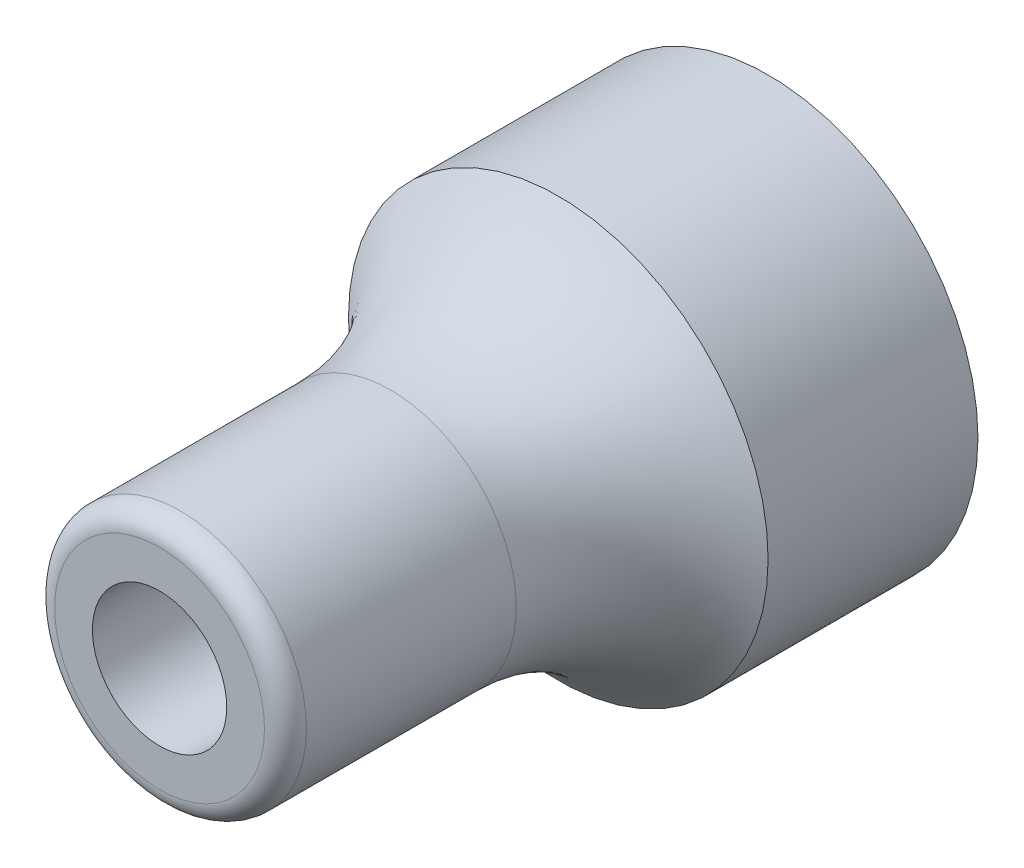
ISO-10303-21;
HEADER;
FILE_DESCRIPTION(('STEP AP214'),'2;1');
FILE_NAME('part.step','',(''),(''),'','','');
FILE_SCHEMA(('AUTOMOTIVE_DESIGN { 1 0 10303 214 1 1 1 1 }'));
ENDSEC;
DATA;
#1=APPLICATION_CONTEXT('core data for automotive mechanical design processes');
#2=APPLICATION_PROTOCOL_DEFINITION('international standard','automotive_design',2000,#1);
#3=PRODUCT_CONTEXT('',#1,'mechanical');
#4=PRODUCT('Part','Part','',(#3));
#5=PRODUCT_RELATED_PRODUCT_CATEGORY('part','',(#4));
#6=PRODUCT_DEFINITION_FORMATION('','',#4);
#7=PRODUCT_DEFINITION_CONTEXT('part definition',#1,'design');
#8=PRODUCT_DEFINITION('design','',#6,#7);
#9=PRODUCT_DEFINITION_SHAPE('','',#8);
#10=(LENGTH_UNIT() NAMED_UNIT(*) SI_UNIT(.MILLI.,.METRE.));
#11=(NAMED_UNIT(*) PLANE_ANGLE_UNIT() SI_UNIT($,.RADIAN.));
#12=(NAMED_UNIT(*) SI_UNIT($,.STERADIAN.) SOLID_ANGLE_UNIT());
#13=UNCERTAINTY_MEASURE_WITH_UNIT(LENGTH_MEASURE(1.E-05),#10,'distance_accuracy_value','');
#14=(GEOMETRIC_REPRESENTATION_CONTEXT(3) GLOBAL_UNCERTAINTY_ASSIGNED_CONTEXT((#13)) GLOBAL_UNIT_ASSIGNED_CONTEXT((#10,
#11,#12)) REPRESENTATION_CONTEXT('',''));
#15=CARTESIAN_POINT('',(0.,0.,0.));
#16=DIRECTION('',(0.,0.,1.));
#17=DIRECTION('',(1.,0.,0.));
#18=AXIS2_PLACEMENT_3D('',#15,#16,#17);
#19=CARTESIAN_POINT('',(0.,0.,10.));
#20=DIRECTION('',(0.,0.,-1.));
#21=DIRECTION('',(-1.,0.,0.));
#22=AXIS2_PLACEMENT_3D('',#19,#20,#21);
#23=CYLINDRICAL_SURFACE('',#22,10.);
#24=CARTESIAN_POINT('',(-10.,0.,1.8));
#25=CARTESIAN_POINT('',(-9.99999957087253,-0.174991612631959,1.80000048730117));
#26=CARTESIAN_POINT('',(-9.99536368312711,-0.349989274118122,1.81440119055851));
#27=CARTESIAN_POINT('',(-9.97732524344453,-0.694853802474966,1.87146363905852));
#28=CARTESIAN_POINT('',(-9.96392109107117,-0.864719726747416,1.91413054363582));
#29=CARTESIAN_POINT('',(-9.92980767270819,-1.19429845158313,2.02612984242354));
#30=CARTESIAN_POINT('',(-9.90911004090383,-1.35402694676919,2.09541978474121));
#31=CARTESIAN_POINT('',(-9.86253803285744,-1.65959752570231,2.25851366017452));
#32=CARTESIAN_POINT('',(-9.83666276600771,-1.80543721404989,2.35232181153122));
#33=CARTESIAN_POINT('',(-9.7815413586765,-2.08378951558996,2.56496822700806));
#34=CARTESIAN_POINT('',(-9.75221915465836,-2.2157921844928,2.68445419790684));
#35=CARTESIAN_POINT('',(-9.6939413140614,-2.45826847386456,2.94368613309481));
#36=CARTESIAN_POINT('',(-9.66498575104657,-2.56873783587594,3.08343609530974));
#37=CARTESIAN_POINT('',(-9.60989621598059,-2.76782790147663,3.38370570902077));
#38=CARTESIAN_POINT('',(-9.58385571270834,-2.85580246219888,3.54467256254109));
#39=CARTESIAN_POINT('',(-9.53869315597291,-3.0032183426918,3.88008468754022));
#40=CARTESIAN_POINT('',(-9.51956917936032,-3.06266759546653,4.05452619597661));
#41=CARTESIAN_POINT('',(-9.49120245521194,-3.14946268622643,4.40616521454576));
#42=CARTESIAN_POINT('',(-9.48166829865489,-3.17775793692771,4.58310420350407));
#43=CARTESIAN_POINT('',(-9.4726966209,-3.20440866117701,4.93945519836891));
#44=CARTESIAN_POINT('',(-9.47325626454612,-3.2027725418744,5.11886649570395));
#45=CARTESIAN_POINT('',(-9.4841523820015,-3.17034761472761,5.46713116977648));
#46=CARTESIAN_POINT('',(-9.4940803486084,-3.14077684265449,5.63611290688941));
#47=CARTESIAN_POINT('',(-9.52192914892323,-3.05530117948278,5.96657768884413));
#48=CARTESIAN_POINT('',(-9.5398508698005,-2.99939336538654,6.1280598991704));
#49=CARTESIAN_POINT('',(-9.5819730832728,-2.86199290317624,6.44179571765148));
#50=CARTESIAN_POINT('',(-9.60626458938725,-2.78012546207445,6.59387243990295));
#51=CARTESIAN_POINT('',(-9.65834889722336,-2.59338988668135,6.88252408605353));
#52=CARTESIAN_POINT('',(-9.68614264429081,-2.4885155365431,7.01909480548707));
#53=CARTESIAN_POINT('',(-9.74372744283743,-2.25281103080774,7.27972934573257));
#54=CARTESIAN_POINT('',(-9.77355041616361,-2.12097872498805,7.40288155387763));
#55=CARTESIAN_POINT('',(-9.83066336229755,-1.8381628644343,7.6255573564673));
#56=CARTESIAN_POINT('',(-9.85795312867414,-1.68717775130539,7.72507902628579));
#57=CARTESIAN_POINT('',(-9.90723579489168,-1.36852316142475,7.89832688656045));
#58=CARTESIAN_POINT('',(-9.92918161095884,-1.20072255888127,7.97182620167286));
#59=CARTESIAN_POINT('',(-9.96496322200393,-0.854271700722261,8.08927919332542));
#60=CARTESIAN_POINT('',(-9.97880160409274,-0.675624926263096,8.13324229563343));
#61=CARTESIAN_POINT('',(-9.99638848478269,-0.320283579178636,8.18880013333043));
#62=CARTESIAN_POINT('',(-10.0005212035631,-0.143800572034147,8.2016281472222));
#63=CARTESIAN_POINT('',(-9.99937310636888,0.208820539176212,8.19804156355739));
#64=CARTESIAN_POINT('',(-9.99409374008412,0.38495869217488,8.18163146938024));
#65=CARTESIAN_POINT('',(-9.97496760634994,0.727070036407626,8.12101977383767));
#66=CARTESIAN_POINT('',(-9.96134973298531,0.893188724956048,8.0775601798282));
#67=CARTESIAN_POINT('',(-9.92715171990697,1.21572330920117,7.9649964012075));
#68=CARTESIAN_POINT('',(-9.90657070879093,1.37213798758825,7.89588900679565));
#69=CARTESIAN_POINT('',(-9.8599106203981,1.67519384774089,7.73205796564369));
#70=CARTESIAN_POINT('',(-9.8337065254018,1.82149124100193,7.63673497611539));
#71=CARTESIAN_POINT('',(-9.7787881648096,2.09642300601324,7.42389225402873));
#72=CARTESIAN_POINT('',(-9.75007318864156,2.22505235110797,7.30636622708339));
#73=CARTESIAN_POINT('',(-9.69185934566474,2.46656642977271,7.04665168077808));
#74=CARTESIAN_POINT('',(-9.6623776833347,2.57857158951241,6.90363946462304));
#75=CARTESIAN_POINT('',(-9.6072088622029,2.77708283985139,6.60021065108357));
#76=CARTESIAN_POINT('',(-9.58152167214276,2.86358914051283,6.4397941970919));
#77=CARTESIAN_POINT('',(-9.5371252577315,3.00815160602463,6.10631284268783));
#78=CARTESIAN_POINT('',(-9.51839313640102,3.06630132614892,5.93329173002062));
#79=CARTESIAN_POINT('',(-9.49022563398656,3.15241336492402,5.57918558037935));
#80=CARTESIAN_POINT('',(-9.48078649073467,3.18038790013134,5.39810383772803));
#81=CARTESIAN_POINT('',(-9.47267855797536,3.20445070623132,5.04224806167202));
#82=CARTESIAN_POINT('',(-9.47352038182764,3.20198776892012,4.86758197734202));
#83=CARTESIAN_POINT('',(-9.4846831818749,3.1687671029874,4.5212859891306));
#84=CARTESIAN_POINT('',(-9.49500367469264,3.13801081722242,4.34965593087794));
#85=CARTESIAN_POINT('',(-9.52361086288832,3.05006664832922,4.01703314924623));
#86=CARTESIAN_POINT('',(-9.54176654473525,2.99331255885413,3.85591360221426));
#87=CARTESIAN_POINT('',(-9.58395951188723,2.85532854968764,3.54535647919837));
#88=CARTESIAN_POINT('',(-9.60799803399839,2.77409348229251,3.3959213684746));
#89=CARTESIAN_POINT('',(-9.66046988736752,2.58558533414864,3.10638074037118));
#90=CARTESIAN_POINT('',(-9.6890423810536,2.47738616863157,2.96690347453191));
#91=CARTESIAN_POINT('',(-9.74674361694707,2.23962799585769,2.70761650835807));
#92=CARTESIAN_POINT('',(-9.77587250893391,2.11006316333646,2.58781218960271));
#93=CARTESIAN_POINT('',(-9.83262216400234,1.8278244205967,2.36708342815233));
#94=CARTESIAN_POINT('',(-9.86015503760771,1.67450270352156,2.26696209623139));
#95=CARTESIAN_POINT('',(-9.90947575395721,1.35232705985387,2.09403962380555));
#96=CARTESIAN_POINT('',(-9.93126558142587,1.18347852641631,2.02122904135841));
#97=CARTESIAN_POINT('',(-9.96536682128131,0.847326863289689,1.90950444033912));
#98=CARTESIAN_POINT('',(-9.97823802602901,0.680753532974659,1.86856309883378));
#99=CARTESIAN_POINT('',(-9.99555387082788,0.342788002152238,1.81381371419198));
#100=CARTESIAN_POINT('',(-10.0000004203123,0.171396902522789,1.79999952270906));
#101=CARTESIAN_POINT('',(-10.,0.,1.8));
#102=B_SPLINE_CURVE_WITH_KNOTS('',3,(#24,#25,#26,#27,#28,#29,#30,#31,#32,#33,#34,#35,#36,#37,
#38,#39,#40,#41,#42,#43,#44,#45,#46,#47,#48,#49,#50,#51,#52,#53,#54,#55,#56,#57,#58,#59,#60,#61,
#62,#63,#64,#65,#66,#67,#68,#69,#70,#71,#72,#73,#74,#75,#76,#77,#78,#79,#80,#81,#82,#83,#84,#85,
#86,#87,#88,#89,#90,#91,#92,#93,#94,#95,#96,#97,#98,#99,#100,#101),.UNSPECIFIED.,.T.,.F.,(4,2,2,
2,2,2,2,2,2,2,2,2,2,2,2,2,2,2,2,2,2,2,2,2,2,2,2,2,2,2,2,2,2,2,2,2,2,2,4),(0.,0.524344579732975,
1.04878489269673,1.57239240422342,2.09609005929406,2.63499436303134,3.17400513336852,
3.72709657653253,4.28003411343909,4.81560979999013,5.35103505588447,5.86414178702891,
6.37730547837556,6.89824391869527,7.41932327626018,7.96534569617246,8.5114125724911,
9.06212942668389,9.61267044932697,10.1410202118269,10.669288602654,11.1836683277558,
11.6981124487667,12.2254671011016,12.7529714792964,13.3024598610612,13.8519437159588,
14.3996022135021,14.9470389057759,15.4685226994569,15.9899799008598,16.5030364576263,
17.0162009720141,17.5502751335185,18.0844951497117,18.6373257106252,19.1899649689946,
19.703654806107,20.2172282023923),.UNSPECIFIED.);
#103=CARTESIAN_POINT('',(-10.,0.,1.8));
#104=VERTEX_POINT('',#103);
#105=EDGE_CURVE('E54',#104,#104,#102,.T.);
#106=ORIENTED_EDGE('',*,*,#105,.F.);
#107=EDGE_LOOP('',(#106));
#108=FACE_BOUND('',#107,.T.);
#109=CARTESIAN_POINT('',(0.,0.,10.));
#110=DIRECTION('',(0.,0.,1.));
#111=DIRECTION('',(1.,0.,0.));
#112=AXIS2_PLACEMENT_3D('',#109,#110,#111);
#113=CIRCLE('',#112,10.);
#114=CARTESIAN_POINT('',(10.,0.,10.));
#115=VERTEX_POINT('',#114);
#116=EDGE_CURVE('E50',#115,#115,#113,.T.);
#117=ORIENTED_EDGE('',*,*,#116,.F.);
#118=EDGE_LOOP('',(#117));
#119=FACE_BOUND('',#118,.T.);
#120=CARTESIAN_POINT('',(0.,0.,0.));
#121=DIRECTION('',(0.,0.,1.));
#122=DIRECTION('',(1.,0.,0.));
#123=AXIS2_PLACEMENT_3D('',#120,#121,#122);
#124=CIRCLE('',#123,10.);
#125=CARTESIAN_POINT('',(10.,0.,0.));
#126=VERTEX_POINT('',#125);
#127=EDGE_CURVE('E51',#126,#126,#124,.T.);
#128=ORIENTED_EDGE('',*,*,#127,.T.);
#129=EDGE_LOOP('',(#128));
#130=FACE_BOUND('',#129,.T.);
#131=ADVANCED_FACE('F30',(#108,#119,#130),#23,.T.);
#132=CARTESIAN_POINT('',(0.,0.,0.));
#133=DIRECTION('',(0.,0.,1.));
#134=DIRECTION('',(1.,0.,0.));
#135=AXIS2_PLACEMENT_3D('',#132,#133,#134);
#136=PLANE('',#135);
#137=ORIENTED_EDGE('',*,*,#127,.F.);
#138=EDGE_LOOP('',(#137));
#139=FACE_BOUND('',#138,.T.);
#140=ADVANCED_FACE('F81',(#139),#136,.F.);
#141=CARTESIAN_POINT('',(-10.001,0.,5.));
#142=DIRECTION('',(1.,0.,0.));
#143=DIRECTION('',(0.,0.,-1.));
#144=AXIS2_PLACEMENT_3D('',#141,#142,#143);
#145=CYLINDRICAL_SURFACE('',#144,3.2);
#146=CARTESIAN_POINT('',(4.,0.,5.));
#147=DIRECTION('',(1.,0.,0.));
#148=DIRECTION('',(0.,0.,-1.));
#149=AXIS2_PLACEMENT_3D('',#146,#147,#148);
#150=CIRCLE('',#149,3.2);
#151=CARTESIAN_POINT('',(4.,0.,1.8));
#152=VERTEX_POINT('',#151);
#153=EDGE_CURVE('E63',#152,#152,#150,.T.);
#154=ORIENTED_EDGE('',*,*,#153,.T.);
#155=EDGE_LOOP('',(#154));
#156=FACE_BOUND('',#155,.T.);
#157=ORIENTED_EDGE('',*,*,#105,.T.);
#158=EDGE_LOOP('',(#157));
#159=FACE_BOUND('',#158,.T.);
#160=ADVANCED_FACE('F65',(#156,#159),#145,.F.);
#161=CARTESIAN_POINT('',(4.,0.,5.));
#162=DIRECTION('',(1.,0.,0.));
#163=DIRECTION('',(0.,0.,-1.));
#164=AXIS2_PLACEMENT_3D('',#161,#162,#163);
#165=PLANE('',#164);
#166=ORIENTED_EDGE('',*,*,#153,.F.);
#167=EDGE_LOOP('',(#166));
#168=FACE_BOUND('',#167,.T.);
#169=ADVANCED_FACE('F73',(#168),#165,.F.);
#170=CARTESIAN_POINT('',(0.,0.,29.));
#171=DIRECTION('',(0.,0.,1.));
#172=DIRECTION('',(1.,0.,0.));
#173=AXIS2_PLACEMENT_3D('',#170,#171,#172);
#174=PLANE('',#173);
#175=CARTESIAN_POINT('',(0.,0.,29.));
#176=DIRECTION('',(0.,0.,1.));
#177=DIRECTION('',(1.,0.,0.));
#178=AXIS2_PLACEMENT_3D('',#175,#176,#177);
#179=CIRCLE('',#178,5.);
#180=CARTESIAN_POINT('',(5.,0.,29.));
#181=VERTEX_POINT('',#180);
#182=EDGE_CURVE('E37',#181,#181,#179,.T.);
#183=ORIENTED_EDGE('',*,*,#182,.T.);
#184=EDGE_LOOP('',(#183));
#185=FACE_BOUND('',#184,.T.);
#186=CARTESIAN_POINT('',(0.,0.,29.));
#187=DIRECTION('',(0.,0.,1.));
#188=DIRECTION('',(1.,0.,0.));
#189=AXIS2_PLACEMENT_3D('',#186,#187,#188);
#190=CIRCLE('',#189,3.2);
#191=CARTESIAN_POINT('',(3.2,0.,29.));
#192=VERTEX_POINT('',#191);
#193=EDGE_CURVE('E120',#192,#192,#190,.T.);
#194=ORIENTED_EDGE('',*,*,#193,.F.);
#195=EDGE_LOOP('',(#194));
#196=FACE_BOUND('',#195,.T.);
#197=ADVANCED_FACE('F75',(#185,#196),#174,.T.);
#198=CARTESIAN_POINT('',(0.,0.,29.));
#199=DIRECTION('',(0.,0.,-1.));
#200=DIRECTION('',(-1.,0.,0.));
#201=AXIS2_PLACEMENT_3D('',#198,#199,#200);
#202=CYLINDRICAL_SURFACE('',#201,6.);
#203=CARTESIAN_POINT('',(0.,0.,28.));
#204=DIRECTION('',(0.,0.,1.));
#205=DIRECTION('',(1.,0.,0.));
#206=AXIS2_PLACEMENT_3D('',#203,#204,#205);
#207=CIRCLE('',#206,6.);
#208=CARTESIAN_POINT('',(6.,0.,28.));
#209=VERTEX_POINT('',#208);
#210=EDGE_CURVE('E10',#209,#209,#207,.F.);
#211=ORIENTED_EDGE('',*,*,#210,.T.);
#212=EDGE_LOOP('',(#211));
#213=FACE_BOUND('',#212,.T.);
#214=CARTESIAN_POINT('',(0.,0.,18.));
#215=DIRECTION('',(0.,0.,-1.));
#216=DIRECTION('',(-1.,0.,0.));
#217=AXIS2_PLACEMENT_3D('',#214,#215,#216);
#218=CIRCLE('',#217,6.);
#219=CARTESIAN_POINT('',(-6.,0.,18.));
#220=VERTEX_POINT('',#219);
#221=EDGE_CURVE('E41',#220,#220,#218,.F.);
#222=ORIENTED_EDGE('',*,*,#221,.T.);
#223=EDGE_LOOP('',(#222));
#224=FACE_BOUND('',#223,.T.);
#225=ADVANCED_FACE('F71',(#213,#224),#202,.T.);
#226=CARTESIAN_POINT('',(0.,0.,29.));
#227=DIRECTION('',(0.,0.,-1.));
#228=DIRECTION('',(-1.,0.,0.));
#229=AXIS2_PLACEMENT_3D('',#226,#227,#228);
#230=CYLINDRICAL_SURFACE('',#229,3.2);
#231=ORIENTED_EDGE('',*,*,#193,.T.);
#232=EDGE_LOOP('',(#231));
#233=FACE_BOUND('',#232,.T.);
#234=CARTESIAN_POINT('',(0.,0.,10.));
#235=DIRECTION('',(0.,0.,1.));
#236=DIRECTION('',(1.,0.,0.));
#237=AXIS2_PLACEMENT_3D('',#234,#235,#236);
#238=CIRCLE('',#237,3.2);
#239=CARTESIAN_POINT('',(3.2,0.,10.));
#240=VERTEX_POINT('',#239);
#241=EDGE_CURVE('E45',#240,#240,#238,.F.);
#242=ORIENTED_EDGE('',*,*,#241,.T.);
#243=EDGE_LOOP('',(#242));
#244=FACE_BOUND('',#243,.T.);
#245=ADVANCED_FACE('F103',(#233,#244),#230,.F.);
#246=CARTESIAN_POINT('',(0.,0.,10.));
#247=DIRECTION('',(0.,0.,1.));
#248=DIRECTION('',(1.,0.,0.));
#249=AXIS2_PLACEMENT_3D('',#246,#247,#248);
#250=PLANE('',#249);
#251=ORIENTED_EDGE('',*,*,#241,.F.);
#252=EDGE_LOOP('',(#251));
#253=FACE_BOUND('',#252,.T.);
#254=ADVANCED_FACE('F96',(#253),#250,.T.);
#255=CARTESIAN_POINT('',(0.,0.,18.));
#256=DIRECTION('',(0.,0.,-1.));
#257=DIRECTION('',(-1.,0.,0.));
#258=AXIS2_PLACEMENT_3D('',#255,#256,#257);
#259=TOROIDAL_SURFACE('',#258,16.,10.);
#260=ORIENTED_EDGE('',*,*,#116,.T.);
#261=EDGE_LOOP('',(#260));
#262=FACE_BOUND('',#261,.T.);
#263=ORIENTED_EDGE('',*,*,#221,.F.);
#264=EDGE_LOOP('',(#263));
#265=FACE_BOUND('',#264,.T.);
#266=ADVANCED_FACE('F94',(#262,#265),#259,.F.);
#267=CARTESIAN_POINT('',(0.,0.,28.));
#268=DIRECTION('',(0.,0.,1.));
#269=DIRECTION('',(1.,0.,0.));
#270=AXIS2_PLACEMENT_3D('',#267,#268,#269);
#271=TOROIDAL_SURFACE('',#270,5.,1.);
#272=ORIENTED_EDGE('',*,*,#210,.F.);
#273=EDGE_LOOP('',(#272));
#274=FACE_BOUND('',#273,.T.);
#275=ORIENTED_EDGE('',*,*,#182,.F.);
#276=EDGE_LOOP('',(#275));
#277=FACE_BOUND('',#276,.T.);
#278=ADVANCED_FACE('F32',(#274,#277),#271,.T.);
#279=CLOSED_SHELL('',(#131,#140,#160,#169,#197,#225,#245,#254,#266,#278));
#280=MANIFOLD_SOLID_BREP('B2',#279);
#281=ADVANCED_BREP_SHAPE_REPRESENTATION('',(#18,#280),#14);
#282=SHAPE_DEFINITION_REPRESENTATION(#9,#281);
ENDSEC;
END-ISO-10303-21;
